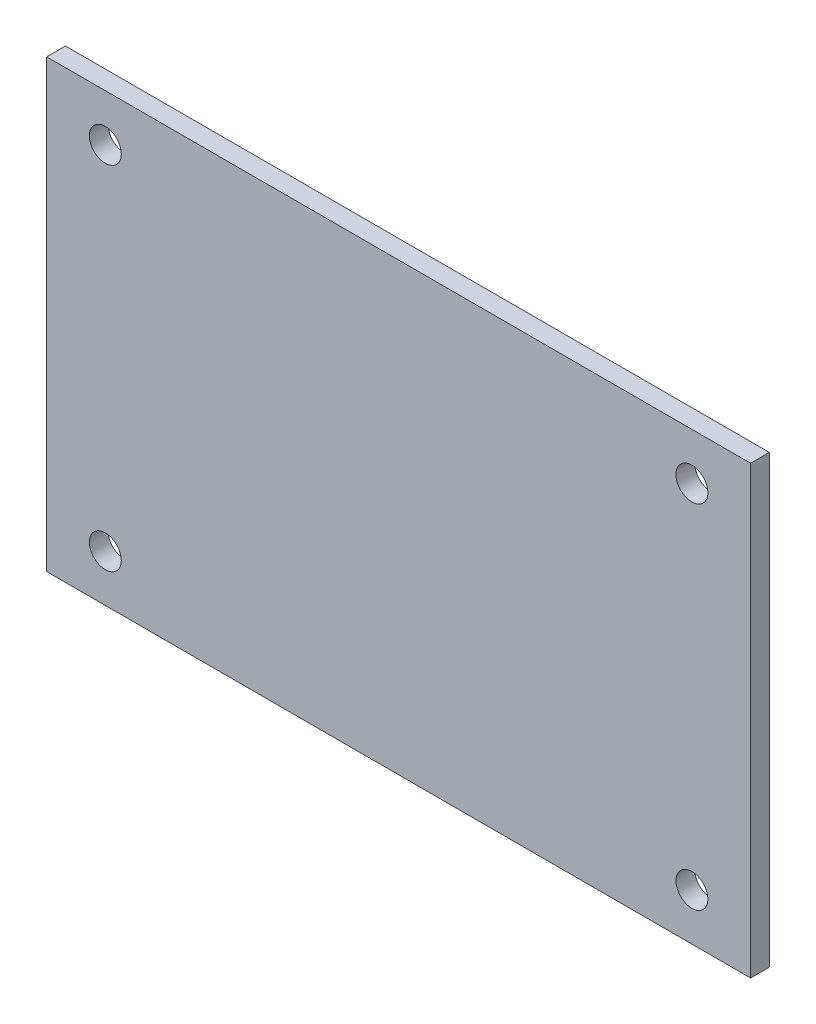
ISO-10303-21;
HEADER;
FILE_DESCRIPTION(('STEP AP214'),'2;1');
FILE_NAME('part.step','',(''),(''),'','','');
FILE_SCHEMA(('AUTOMOTIVE_DESIGN { 1 0 10303 214 1 1 1 1 }'));
ENDSEC;
DATA;
#1=APPLICATION_CONTEXT('core data for automotive mechanical design processes');
#2=APPLICATION_PROTOCOL_DEFINITION('international standard','automotive_design',2000,#1);
#3=PRODUCT_CONTEXT('',#1,'mechanical');
#4=PRODUCT('Part','Part','',(#3));
#5=PRODUCT_RELATED_PRODUCT_CATEGORY('part','',(#4));
#6=PRODUCT_DEFINITION_FORMATION('','',#4);
#7=PRODUCT_DEFINITION_CONTEXT('part definition',#1,'design');
#8=PRODUCT_DEFINITION('design','',#6,#7);
#9=PRODUCT_DEFINITION_SHAPE('','',#8);
#10=(LENGTH_UNIT() NAMED_UNIT(*) SI_UNIT(.MILLI.,.METRE.));
#11=(NAMED_UNIT(*) PLANE_ANGLE_UNIT() SI_UNIT($,.RADIAN.));
#12=(NAMED_UNIT(*) SI_UNIT($,.STERADIAN.) SOLID_ANGLE_UNIT());
#13=UNCERTAINTY_MEASURE_WITH_UNIT(LENGTH_MEASURE(1.E-05),#10,'distance_accuracy_value','');
#14=(GEOMETRIC_REPRESENTATION_CONTEXT(3) GLOBAL_UNCERTAINTY_ASSIGNED_CONTEXT((#13)) GLOBAL_UNIT_ASSIGNED_CONTEXT((#10,
#11,#12)) REPRESENTATION_CONTEXT('',''));
#15=CARTESIAN_POINT('',(0.,0.,0.));
#16=DIRECTION('',(0.,0.,1.));
#17=DIRECTION('',(1.,0.,0.));
#18=AXIS2_PLACEMENT_3D('',#15,#16,#17);
#19=CARTESIAN_POINT('',(-75.,95.,-4.));
#20=DIRECTION('',(-1.,0.,0.));
#21=DIRECTION('',(0.,-1.00000000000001,0.));
#22=AXIS2_PLACEMENT_3D('',#19,#20,#21);
#23=PLANE('',#22);
#24=DIRECTION('',(0.,-1.00000000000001,0.));
#25=VECTOR('',#24,1.);
#26=CARTESIAN_POINT('',(-75.,95.,0.));
#27=LINE('',#26,#25);
#28=CARTESIAN_POINT('',(-75.,95.,0.));
#29=VERTEX_POINT('',#28);
#30=CARTESIAN_POINT('',(-75.,0.,-1.0547118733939E-12));
#31=VERTEX_POINT('',#30);
#32=EDGE_CURVE('E79',#29,#31,#27,.T.);
#33=ORIENTED_EDGE('',*,*,#32,.F.);
#34=DIRECTION('',(0.,0.,1.));
#35=VECTOR('',#34,1.);
#36=CARTESIAN_POINT('',(-75.,95.,-4.));
#37=LINE('',#36,#35);
#38=CARTESIAN_POINT('',(-75.,95.,-4.));
#39=VERTEX_POINT('',#38);
#40=EDGE_CURVE('E11',#39,#29,#37,.T.);
#41=ORIENTED_EDGE('',*,*,#40,.F.);
#42=DIRECTION('',(0.,-1.00000000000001,0.));
#43=VECTOR('',#42,1.);
#44=CARTESIAN_POINT('',(-75.,95.,-4.));
#45=LINE('',#44,#43);
#46=CARTESIAN_POINT('',(-75.,0.,-4.00000000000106));
#47=VERTEX_POINT('',#46);
#48=EDGE_CURVE('E81',#39,#47,#45,.T.);
#49=ORIENTED_EDGE('',*,*,#48,.T.);
#50=DIRECTION('',(0.,0.,1.));
#51=VECTOR('',#50,1.);
#52=CARTESIAN_POINT('',(-75.,0.,-4.00000000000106));
#53=LINE('',#52,#51);
#54=EDGE_CURVE('E41',#47,#31,#53,.T.);
#55=ORIENTED_EDGE('',*,*,#54,.T.);
#56=EDGE_LOOP('',(#33,#41,#49,#55));
#57=FACE_BOUND('',#56,.T.);
#58=ADVANCED_FACE('F38',(#57),#23,.T.);
#59=CARTESIAN_POINT('',(-75.,95.,-4.));
#60=DIRECTION('',(0.,1.00000000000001,0.));
#61=DIRECTION('',(0.,0.,1.));
#62=AXIS2_PLACEMENT_3D('',#59,#60,#61);
#63=PLANE('',#62);
#64=DIRECTION('',(-1.,0.,0.));
#65=VECTOR('',#64,1.);
#66=CARTESIAN_POINT('',(-75.,95.,0.));
#67=LINE('',#66,#65);
#68=CARTESIAN_POINT('',(75.,95.,-1.0547118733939E-12));
#69=VERTEX_POINT('',#68);
#70=EDGE_CURVE('E98',#69,#29,#67,.T.);
#71=ORIENTED_EDGE('',*,*,#70,.F.);
#72=DIRECTION('',(0.,0.,1.));
#73=VECTOR('',#72,1.);
#74=CARTESIAN_POINT('',(75.,95.,-4.00000000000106));
#75=LINE('',#74,#73);
#76=CARTESIAN_POINT('',(75.,95.,-4.00000000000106));
#77=VERTEX_POINT('',#76);
#78=EDGE_CURVE('E47',#77,#69,#75,.T.);
#79=ORIENTED_EDGE('',*,*,#78,.F.);
#80=DIRECTION('',(-1.,0.,0.));
#81=VECTOR('',#80,1.);
#82=CARTESIAN_POINT('',(-75.,95.,-4.));
#83=LINE('',#82,#81);
#84=EDGE_CURVE('E87',#77,#39,#83,.T.);
#85=ORIENTED_EDGE('',*,*,#84,.T.);
#86=ORIENTED_EDGE('',*,*,#40,.T.);
#87=EDGE_LOOP('',(#71,#79,#85,#86));
#88=FACE_BOUND('',#87,.T.);
#89=ADVANCED_FACE('F168',(#88),#63,.T.);
#90=CARTESIAN_POINT('',(75.,95.,-4.00000000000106));
#91=DIRECTION('',(1.,0.,0.));
#92=DIRECTION('',(0.,1.00000000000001,0.));
#93=AXIS2_PLACEMENT_3D('',#90,#91,#92);
#94=PLANE('',#93);
#95=DIRECTION('',(0.,1.00000000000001,0.));
#96=VECTOR('',#95,1.);
#97=CARTESIAN_POINT('',(75.,95.,-1.0547118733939E-12));
#98=LINE('',#97,#96);
#99=CARTESIAN_POINT('',(75.,0.,0.));
#100=VERTEX_POINT('',#99);
#101=EDGE_CURVE('E95',#100,#69,#98,.T.);
#102=ORIENTED_EDGE('',*,*,#101,.F.);
#103=DIRECTION('',(0.,0.,1.));
#104=VECTOR('',#103,1.);
#105=CARTESIAN_POINT('',(75.,0.,-4.00000000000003));
#106=LINE('',#105,#104);
#107=CARTESIAN_POINT('',(75.,0.,-4.00000000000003));
#108=VERTEX_POINT('',#107);
#109=EDGE_CURVE('E86',#108,#100,#106,.T.);
#110=ORIENTED_EDGE('',*,*,#109,.F.);
#111=DIRECTION('',(0.,1.00000000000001,0.));
#112=VECTOR('',#111,1.);
#113=CARTESIAN_POINT('',(75.,95.,-4.00000000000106));
#114=LINE('',#113,#112);
#115=EDGE_CURVE('E118',#108,#77,#114,.T.);
#116=ORIENTED_EDGE('',*,*,#115,.T.);
#117=ORIENTED_EDGE('',*,*,#78,.T.);
#118=EDGE_LOOP('',(#102,#110,#116,#117));
#119=FACE_BOUND('',#118,.T.);
#120=ADVANCED_FACE('F172',(#119),#94,.T.);
#121=CARTESIAN_POINT('',(-75.,0.,-4.00000000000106));
#122=DIRECTION('',(0.,-1.00000000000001,0.));
#123=DIRECTION('',(0.,0.,-1.));
#124=AXIS2_PLACEMENT_3D('',#121,#122,#123);
#125=PLANE('',#124);
#126=DIRECTION('',(1.,0.,0.));
#127=VECTOR('',#126,1.);
#128=CARTESIAN_POINT('',(-75.,0.,-1.0547118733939E-12));
#129=LINE('',#128,#127);
#130=EDGE_CURVE('E89',#31,#100,#129,.T.);
#131=ORIENTED_EDGE('',*,*,#130,.F.);
#132=ORIENTED_EDGE('',*,*,#54,.F.);
#133=DIRECTION('',(1.,0.,0.));
#134=VECTOR('',#133,1.);
#135=CARTESIAN_POINT('',(-75.,0.,-4.00000000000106));
#136=LINE('',#135,#134);
#137=EDGE_CURVE('E115',#47,#108,#136,.T.);
#138=ORIENTED_EDGE('',*,*,#137,.T.);
#139=ORIENTED_EDGE('',*,*,#109,.T.);
#140=EDGE_LOOP('',(#131,#132,#138,#139));
#141=FACE_BOUND('',#140,.T.);
#142=ADVANCED_FACE('F90',(#141),#125,.T.);
#143=CARTESIAN_POINT('',(-75.,0.,-4.00000000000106));
#144=DIRECTION('',(0.,0.,1.));
#145=DIRECTION('',(1.,0.,0.));
#146=AXIS2_PLACEMENT_3D('',#143,#144,#145);
#147=PLANE('',#146);
#148=CARTESIAN_POINT('',(62.5000000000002,85.,-3.99999999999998));
#149=DIRECTION('',(0.,0.,1.));
#150=DIRECTION('',(1.,0.,0.));
#151=AXIS2_PLACEMENT_3D('',#148,#149,#150);
#152=CIRCLE('',#151,3.4);
#153=CARTESIAN_POINT('',(65.9000000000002,85.,-3.99999999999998));
#154=VERTEX_POINT('',#153);
#155=EDGE_CURVE('E131',#154,#154,#152,.T.);
#156=ORIENTED_EDGE('',*,*,#155,.T.);
#157=EDGE_LOOP('',(#156));
#158=FACE_BOUND('',#157,.T.);
#159=CARTESIAN_POINT('',(62.5000000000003,10.,-4.));
#160=DIRECTION('',(0.,0.,1.));
#161=DIRECTION('',(1.,0.,0.));
#162=AXIS2_PLACEMENT_3D('',#159,#160,#161);
#163=CIRCLE('',#162,3.4);
#164=CARTESIAN_POINT('',(65.9000000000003,10.,-4.));
#165=VERTEX_POINT('',#164);
#166=EDGE_CURVE('E130',#165,#165,#163,.T.);
#167=ORIENTED_EDGE('',*,*,#166,.T.);
#168=EDGE_LOOP('',(#167));
#169=FACE_BOUND('',#168,.T.);
#170=CARTESIAN_POINT('',(-62.5,85.,-4.));
#171=DIRECTION('',(0.,0.,1.));
#172=DIRECTION('',(1.,0.,0.));
#173=AXIS2_PLACEMENT_3D('',#170,#171,#172);
#174=CIRCLE('',#173,3.4);
#175=CARTESIAN_POINT('',(-59.1,85.,-4.));
#176=VERTEX_POINT('',#175);
#177=EDGE_CURVE('E140',#176,#176,#174,.T.);
#178=ORIENTED_EDGE('',*,*,#177,.T.);
#179=EDGE_LOOP('',(#178));
#180=FACE_BOUND('',#179,.T.);
#181=CARTESIAN_POINT('',(-62.5,10.0000000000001,-4.00000000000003));
#182=DIRECTION('',(0.,0.,1.));
#183=DIRECTION('',(1.,0.,0.));
#184=AXIS2_PLACEMENT_3D('',#181,#182,#183);
#185=CIRCLE('',#184,3.4);
#186=CARTESIAN_POINT('',(-59.1,10.0000000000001,-4.00000000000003));
#187=VERTEX_POINT('',#186);
#188=EDGE_CURVE('E100',#187,#187,#185,.T.);
#189=ORIENTED_EDGE('',*,*,#188,.T.);
#190=EDGE_LOOP('',(#189));
#191=FACE_BOUND('',#190,.T.);
#192=ORIENTED_EDGE('',*,*,#48,.F.);
#193=ORIENTED_EDGE('',*,*,#84,.F.);
#194=ORIENTED_EDGE('',*,*,#115,.F.);
#195=ORIENTED_EDGE('',*,*,#137,.F.);
#196=EDGE_LOOP('',(#192,#193,#194,#195));
#197=FACE_BOUND('',#196,.T.);
#198=ADVANCED_FACE('F153',(#158,#169,#180,#191,#197),#147,.F.);
#199=CARTESIAN_POINT('',(-75.,0.,-1.0547118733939E-12));
#200=DIRECTION('',(0.,0.,1.));
#201=DIRECTION('',(1.,0.,0.));
#202=AXIS2_PLACEMENT_3D('',#199,#200,#201);
#203=PLANE('',#202);
#204=CARTESIAN_POINT('',(62.5000000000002,85.,0.));
#205=DIRECTION('',(0.,0.,1.));
#206=DIRECTION('',(1.,0.,0.));
#207=AXIS2_PLACEMENT_3D('',#204,#205,#206);
#208=CIRCLE('',#207,3.4);
#209=CARTESIAN_POINT('',(65.9000000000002,85.,0.));
#210=VERTEX_POINT('',#209);
#211=EDGE_CURVE('E259',#210,#210,#208,.T.);
#212=ORIENTED_EDGE('',*,*,#211,.F.);
#213=EDGE_LOOP('',(#212));
#214=FACE_BOUND('',#213,.T.);
#215=CARTESIAN_POINT('',(62.5000000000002,10.,0.));
#216=DIRECTION('',(0.,0.,1.));
#217=DIRECTION('',(1.,0.,0.));
#218=AXIS2_PLACEMENT_3D('',#215,#216,#217);
#219=CIRCLE('',#218,3.4);
#220=CARTESIAN_POINT('',(65.9000000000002,10.,0.));
#221=VERTEX_POINT('',#220);
#222=EDGE_CURVE('E127',#221,#221,#219,.T.);
#223=ORIENTED_EDGE('',*,*,#222,.F.);
#224=EDGE_LOOP('',(#223));
#225=FACE_BOUND('',#224,.T.);
#226=CARTESIAN_POINT('',(-62.5,85.,0.));
#227=DIRECTION('',(0.,0.,1.));
#228=DIRECTION('',(1.,0.,0.));
#229=AXIS2_PLACEMENT_3D('',#226,#227,#228);
#230=CIRCLE('',#229,3.4);
#231=CARTESIAN_POINT('',(-59.1,85.,0.));
#232=VERTEX_POINT('',#231);
#233=EDGE_CURVE('E134',#232,#232,#230,.T.);
#234=ORIENTED_EDGE('',*,*,#233,.F.);
#235=EDGE_LOOP('',(#234));
#236=FACE_BOUND('',#235,.T.);
#237=CARTESIAN_POINT('',(-62.5,10.0000000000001,0.));
#238=DIRECTION('',(0.,0.,1.));
#239=DIRECTION('',(1.,0.,0.));
#240=AXIS2_PLACEMENT_3D('',#237,#238,#239);
#241=CIRCLE('',#240,3.4);
#242=CARTESIAN_POINT('',(-59.1,10.0000000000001,0.));
#243=VERTEX_POINT('',#242);
#244=EDGE_CURVE('E105',#243,#243,#241,.T.);
#245=ORIENTED_EDGE('',*,*,#244,.F.);
#246=EDGE_LOOP('',(#245));
#247=FACE_BOUND('',#246,.T.);
#248=ORIENTED_EDGE('',*,*,#32,.T.);
#249=ORIENTED_EDGE('',*,*,#130,.T.);
#250=ORIENTED_EDGE('',*,*,#101,.T.);
#251=ORIENTED_EDGE('',*,*,#70,.T.);
#252=EDGE_LOOP('',(#248,#249,#250,#251));
#253=FACE_BOUND('',#252,.T.);
#254=ADVANCED_FACE('F97',(#214,#225,#236,#247,#253),#203,.T.);
#255=CARTESIAN_POINT('',(-62.5,10.0000000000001,-4.00000000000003));
#256=DIRECTION('',(0.,0.,1.));
#257=DIRECTION('',(1.,0.,0.));
#258=AXIS2_PLACEMENT_3D('',#255,#256,#257);
#259=CYLINDRICAL_SURFACE('',#258,3.4);
#260=ORIENTED_EDGE('',*,*,#188,.F.);
#261=EDGE_LOOP('',(#260));
#262=FACE_BOUND('',#261,.T.);
#263=ORIENTED_EDGE('',*,*,#244,.T.);
#264=EDGE_LOOP('',(#263));
#265=FACE_BOUND('',#264,.T.);
#266=ADVANCED_FACE('F150',(#262,#265),#259,.F.);
#267=CARTESIAN_POINT('',(-62.5,85.,-4.));
#268=DIRECTION('',(0.,0.,1.));
#269=DIRECTION('',(1.,0.,0.));
#270=AXIS2_PLACEMENT_3D('',#267,#268,#269);
#271=CYLINDRICAL_SURFACE('',#270,3.4);
#272=ORIENTED_EDGE('',*,*,#177,.F.);
#273=EDGE_LOOP('',(#272));
#274=FACE_BOUND('',#273,.T.);
#275=ORIENTED_EDGE('',*,*,#233,.T.);
#276=EDGE_LOOP('',(#275));
#277=FACE_BOUND('',#276,.T.);
#278=ADVANCED_FACE('F160',(#274,#277),#271,.F.);
#279=CARTESIAN_POINT('',(62.5000000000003,10.,-4.));
#280=DIRECTION('',(0.,0.,1.));
#281=DIRECTION('',(1.,0.,0.));
#282=AXIS2_PLACEMENT_3D('',#279,#280,#281);
#283=CYLINDRICAL_SURFACE('',#282,3.4);
#284=ORIENTED_EDGE('',*,*,#166,.F.);
#285=EDGE_LOOP('',(#284));
#286=FACE_BOUND('',#285,.T.);
#287=ORIENTED_EDGE('',*,*,#222,.T.);
#288=EDGE_LOOP('',(#287));
#289=FACE_BOUND('',#288,.T.);
#290=ADVANCED_FACE('F204',(#286,#289),#283,.F.);
#291=CARTESIAN_POINT('',(62.5000000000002,85.,-3.99999999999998));
#292=DIRECTION('',(0.,0.,1.));
#293=DIRECTION('',(1.,0.,0.));
#294=AXIS2_PLACEMENT_3D('',#291,#292,#293);
#295=CYLINDRICAL_SURFACE('',#294,3.4);
#296=ORIENTED_EDGE('',*,*,#155,.F.);
#297=EDGE_LOOP('',(#296));
#298=FACE_BOUND('',#297,.T.);
#299=ORIENTED_EDGE('',*,*,#211,.T.);
#300=EDGE_LOOP('',(#299));
#301=FACE_BOUND('',#300,.T.);
#302=ADVANCED_FACE('F213',(#298,#301),#295,.F.);
#303=CLOSED_SHELL('',(#58,#89,#120,#142,#198,#254,#266,#278,#290,#302));
#304=MANIFOLD_SOLID_BREP('B2',#303);
#305=ADVANCED_BREP_SHAPE_REPRESENTATION('',(#18,#304),#14);
#306=SHAPE_DEFINITION_REPRESENTATION(#9,#305);
ENDSEC;
END-ISO-10303-21;
